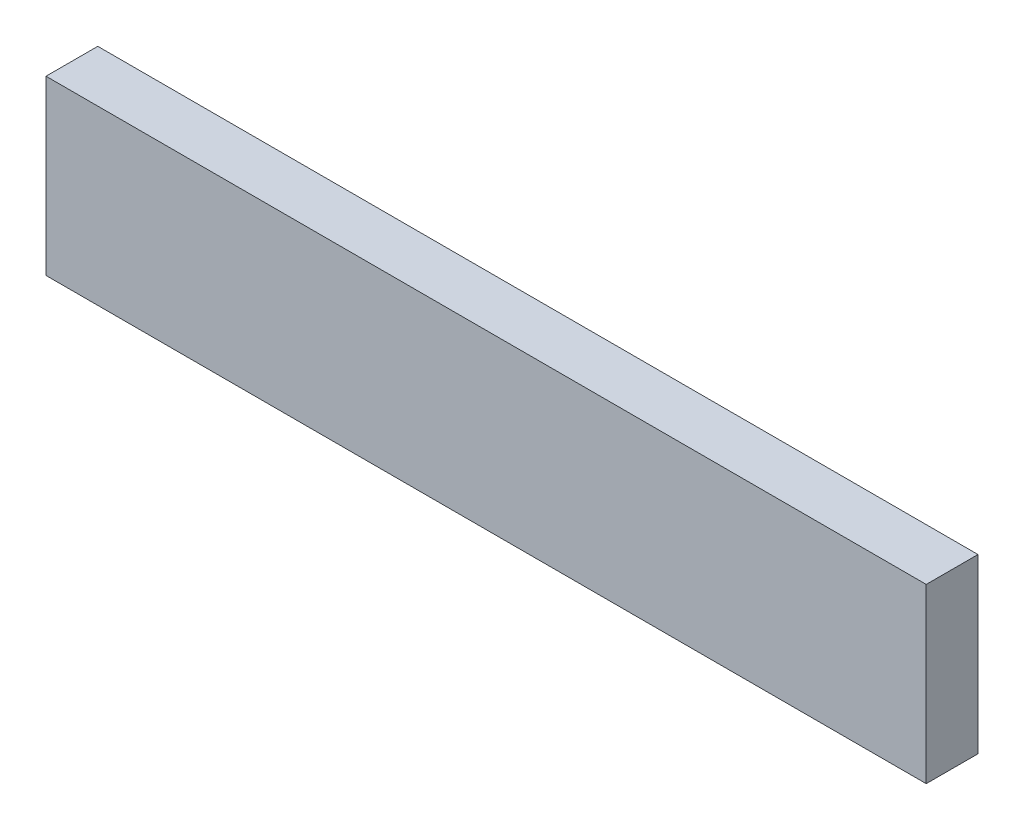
ISO-10303-21;
HEADER;
FILE_DESCRIPTION(('STEP AP214'),'2;1');
FILE_NAME('part.step','',(''),(''),'','','');
FILE_SCHEMA(('AUTOMOTIVE_DESIGN { 1 0 10303 214 1 1 1 1 }'));
ENDSEC;
DATA;
#1=APPLICATION_CONTEXT('core data for automotive mechanical design processes');
#2=APPLICATION_PROTOCOL_DEFINITION('international standard','automotive_design',2000,#1);
#3=PRODUCT_CONTEXT('',#1,'mechanical');
#4=PRODUCT('Part','Part','',(#3));
#5=PRODUCT_RELATED_PRODUCT_CATEGORY('part','',(#4));
#6=PRODUCT_DEFINITION_FORMATION('','',#4);
#7=PRODUCT_DEFINITION_CONTEXT('part definition',#1,'design');
#8=PRODUCT_DEFINITION('design','',#6,#7);
#9=PRODUCT_DEFINITION_SHAPE('','',#8);
#10=(LENGTH_UNIT() NAMED_UNIT(*) SI_UNIT(.MILLI.,.METRE.));
#11=(NAMED_UNIT(*) PLANE_ANGLE_UNIT() SI_UNIT($,.RADIAN.));
#12=(NAMED_UNIT(*) SI_UNIT($,.STERADIAN.) SOLID_ANGLE_UNIT());
#13=UNCERTAINTY_MEASURE_WITH_UNIT(LENGTH_MEASURE(1.E-05),#10,'distance_accuracy_value','');
#14=(GEOMETRIC_REPRESENTATION_CONTEXT(3) GLOBAL_UNCERTAINTY_ASSIGNED_CONTEXT((#13)) GLOBAL_UNIT_ASSIGNED_CONTEXT((#10,
#11,#12)) REPRESENTATION_CONTEXT('',''));
#15=CARTESIAN_POINT('',(0.,0.,0.));
#16=DIRECTION('',(0.,0.,1.));
#17=DIRECTION('',(1.,0.,0.));
#18=AXIS2_PLACEMENT_3D('',#15,#16,#17);
#19=CARTESIAN_POINT('',(-25.908,27.681193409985,1.524));
#20=DIRECTION('',(1.,0.,0.));
#21=DIRECTION('',(0.,0.,-1.));
#22=AXIS2_PLACEMENT_3D('',#19,#20,#21);
#23=PLANE('',#22);
#24=DIRECTION('',(0.,-1.,0.));
#25=VECTOR('',#24,1.);
#26=CARTESIAN_POINT('',(-25.908,27.681193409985,0.));
#27=LINE('',#26,#25);
#28=CARTESIAN_POINT('',(-25.908,27.681193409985,0.));
#29=VERTEX_POINT('',#28);
#30=CARTESIAN_POINT('',(-25.908,22.601193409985,0.));
#31=VERTEX_POINT('',#30);
#32=EDGE_CURVE('E99',#29,#31,#27,.T.);
#33=ORIENTED_EDGE('',*,*,#32,.T.);
#34=DIRECTION('',(0.,0.,-1.));
#35=VECTOR('',#34,1.);
#36=CARTESIAN_POINT('',(-25.908,22.601193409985,1.524));
#37=LINE('',#36,#35);
#38=CARTESIAN_POINT('',(-25.908,22.601193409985,1.524));
#39=VERTEX_POINT('',#38);
#40=EDGE_CURVE('E11',#39,#31,#37,.T.);
#41=ORIENTED_EDGE('',*,*,#40,.F.);
#42=DIRECTION('',(0.,-1.,0.));
#43=VECTOR('',#42,1.);
#44=CARTESIAN_POINT('',(-25.908,27.681193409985,1.524));
#45=LINE('',#44,#43);
#46=CARTESIAN_POINT('',(-25.908,27.681193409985,1.524));
#47=VERTEX_POINT('',#46);
#48=EDGE_CURVE('E87',#47,#39,#45,.T.);
#49=ORIENTED_EDGE('',*,*,#48,.F.);
#50=DIRECTION('',(0.,0.,-1.));
#51=VECTOR('',#50,1.);
#52=CARTESIAN_POINT('',(-25.908,27.681193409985,1.524));
#53=LINE('',#52,#51);
#54=EDGE_CURVE('E95',#47,#29,#53,.T.);
#55=ORIENTED_EDGE('',*,*,#54,.T.);
#56=EDGE_LOOP('',(#33,#41,#49,#55));
#57=FACE_BOUND('',#56,.T.);
#58=ADVANCED_FACE('F36',(#57),#23,.F.);
#59=CARTESIAN_POINT('',(-25.908,22.601193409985,1.524));
#60=DIRECTION('',(0.,1.,0.));
#61=DIRECTION('',(-1.,0.,0.));
#62=AXIS2_PLACEMENT_3D('',#59,#60,#61);
#63=PLANE('',#62);
#64=DIRECTION('',(1.,0.,0.));
#65=VECTOR('',#64,1.);
#66=CARTESIAN_POINT('',(-25.908,22.601193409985,0.));
#67=LINE('',#66,#65);
#68=CARTESIAN_POINT('',(0.,22.601193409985,0.));
#69=VERTEX_POINT('',#68);
#70=EDGE_CURVE('E91',#31,#69,#67,.T.);
#71=ORIENTED_EDGE('',*,*,#70,.T.);
#72=DIRECTION('',(0.,0.,-1.));
#73=VECTOR('',#72,1.);
#74=CARTESIAN_POINT('',(0.,22.601193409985,1.524));
#75=LINE('',#74,#73);
#76=CARTESIAN_POINT('',(0.,22.601193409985,1.524));
#77=VERTEX_POINT('',#76);
#78=EDGE_CURVE('E44',#77,#69,#75,.T.);
#79=ORIENTED_EDGE('',*,*,#78,.F.);
#80=DIRECTION('',(1.,0.,0.));
#81=VECTOR('',#80,1.);
#82=CARTESIAN_POINT('',(-25.908,22.601193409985,1.524));
#83=LINE('',#82,#81);
#84=EDGE_CURVE('E82',#39,#77,#83,.T.);
#85=ORIENTED_EDGE('',*,*,#84,.F.);
#86=ORIENTED_EDGE('',*,*,#40,.T.);
#87=EDGE_LOOP('',(#71,#79,#85,#86));
#88=FACE_BOUND('',#87,.T.);
#89=ADVANCED_FACE('F90',(#88),#63,.F.);
#90=CARTESIAN_POINT('',(0.,22.601193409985,1.524));
#91=DIRECTION('',(-1.,0.,0.));
#92=DIRECTION('',(0.,0.,1.));
#93=AXIS2_PLACEMENT_3D('',#90,#91,#92);
#94=PLANE('',#93);
#95=DIRECTION('',(0.,1.,0.));
#96=VECTOR('',#95,1.);
#97=CARTESIAN_POINT('',(0.,22.601193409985,0.));
#98=LINE('',#97,#96);
#99=CARTESIAN_POINT('',(0.,27.681193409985,0.));
#100=VERTEX_POINT('',#99);
#101=EDGE_CURVE('E69',#69,#100,#98,.T.);
#102=ORIENTED_EDGE('',*,*,#101,.T.);
#103=DIRECTION('',(0.,0.,-1.));
#104=VECTOR('',#103,1.);
#105=CARTESIAN_POINT('',(0.,27.681193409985,1.524));
#106=LINE('',#105,#104);
#107=CARTESIAN_POINT('',(0.,27.681193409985,1.524));
#108=VERTEX_POINT('',#107);
#109=EDGE_CURVE('E92',#108,#100,#106,.T.);
#110=ORIENTED_EDGE('',*,*,#109,.F.);
#111=DIRECTION('',(0.,1.,0.));
#112=VECTOR('',#111,1.);
#113=CARTESIAN_POINT('',(0.,22.601193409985,1.524));
#114=LINE('',#113,#112);
#115=EDGE_CURVE('E85',#77,#108,#114,.T.);
#116=ORIENTED_EDGE('',*,*,#115,.F.);
#117=ORIENTED_EDGE('',*,*,#78,.T.);
#118=EDGE_LOOP('',(#102,#110,#116,#117));
#119=FACE_BOUND('',#118,.T.);
#120=ADVANCED_FACE('F93',(#119),#94,.F.);
#121=CARTESIAN_POINT('',(0.,27.681193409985,1.524));
#122=DIRECTION('',(0.,-1.,0.));
#123=DIRECTION('',(0.,0.,-1.));
#124=AXIS2_PLACEMENT_3D('',#121,#122,#123);
#125=PLANE('',#124);
#126=DIRECTION('',(-1.,0.,0.));
#127=VECTOR('',#126,1.);
#128=CARTESIAN_POINT('',(0.,27.681193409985,0.));
#129=LINE('',#128,#127);
#130=EDGE_CURVE('E75',#100,#29,#129,.T.);
#131=ORIENTED_EDGE('',*,*,#130,.T.);
#132=ORIENTED_EDGE('',*,*,#54,.F.);
#133=DIRECTION('',(-1.,0.,0.));
#134=VECTOR('',#133,1.);
#135=CARTESIAN_POINT('',(0.,27.681193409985,1.524));
#136=LINE('',#135,#134);
#137=EDGE_CURVE('E52',#108,#47,#136,.T.);
#138=ORIENTED_EDGE('',*,*,#137,.F.);
#139=ORIENTED_EDGE('',*,*,#109,.T.);
#140=EDGE_LOOP('',(#131,#132,#138,#139));
#141=FACE_BOUND('',#140,.T.);
#142=ADVANCED_FACE('F106',(#141),#125,.F.);
#143=CARTESIAN_POINT('',(0.,0.,1.524));
#144=DIRECTION('',(0.,0.,1.));
#145=DIRECTION('',(1.,0.,0.));
#146=AXIS2_PLACEMENT_3D('',#143,#144,#145);
#147=PLANE('',#146);
#148=ORIENTED_EDGE('',*,*,#48,.T.);
#149=ORIENTED_EDGE('',*,*,#84,.T.);
#150=ORIENTED_EDGE('',*,*,#115,.T.);
#151=ORIENTED_EDGE('',*,*,#137,.T.);
#152=EDGE_LOOP('',(#148,#149,#150,#151));
#153=FACE_BOUND('',#152,.T.);
#154=ADVANCED_FACE('F83',(#153),#147,.T.);
#155=CARTESIAN_POINT('',(0.,0.,0.));
#156=DIRECTION('',(0.,0.,1.));
#157=DIRECTION('',(1.,0.,0.));
#158=AXIS2_PLACEMENT_3D('',#155,#156,#157);
#159=PLANE('',#158);
#160=ORIENTED_EDGE('',*,*,#32,.F.);
#161=ORIENTED_EDGE('',*,*,#130,.F.);
#162=ORIENTED_EDGE('',*,*,#101,.F.);
#163=ORIENTED_EDGE('',*,*,#70,.F.);
#164=EDGE_LOOP('',(#160,#161,#162,#163));
#165=FACE_BOUND('',#164,.T.);
#166=ADVANCED_FACE('F109',(#165),#159,.F.);
#167=CLOSED_SHELL('',(#58,#89,#120,#142,#154,#166));
#168=MANIFOLD_SOLID_BREP('B2',#167);
#169=ADVANCED_BREP_SHAPE_REPRESENTATION('',(#18,#168),#14);
#170=SHAPE_DEFINITION_REPRESENTATION(#9,#169);
ENDSEC;
END-ISO-10303-21;
